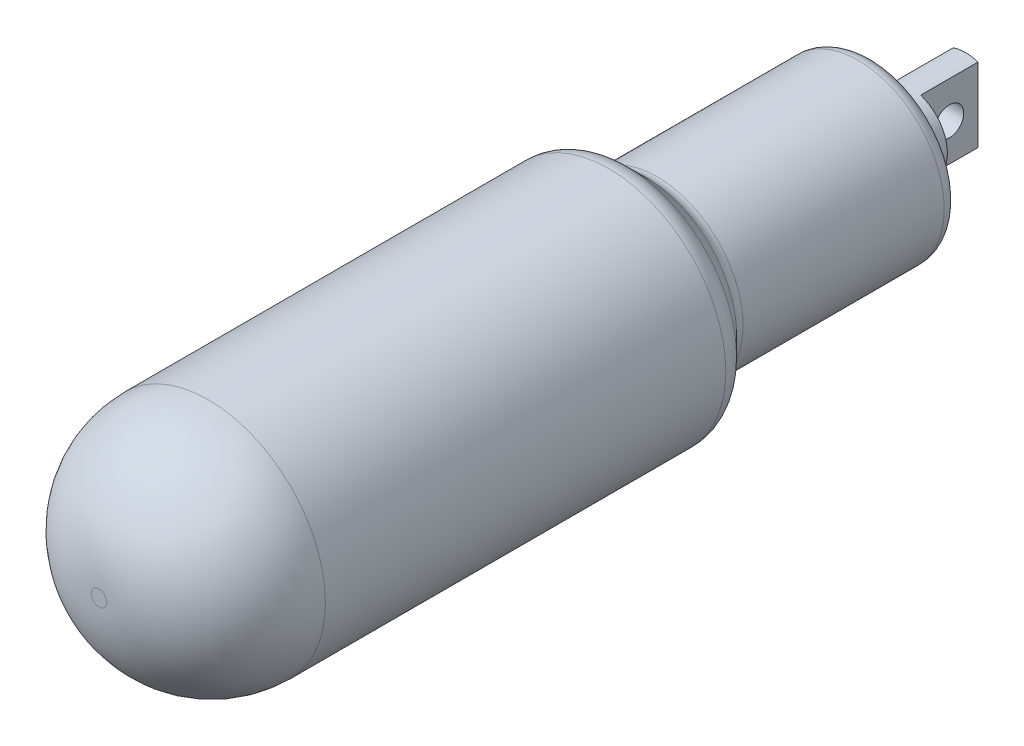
ISO-10303-21;
HEADER;
FILE_DESCRIPTION(('STEP AP214'),'2;1');
FILE_NAME('part.step','',(''),(''),'','','');
FILE_SCHEMA(('AUTOMOTIVE_DESIGN { 1 0 10303 214 1 1 1 1 }'));
ENDSEC;
DATA;
#1=APPLICATION_CONTEXT('core data for automotive mechanical design processes');
#2=APPLICATION_PROTOCOL_DEFINITION('international standard','automotive_design',2000,#1);
#3=PRODUCT_CONTEXT('',#1,'mechanical');
#4=PRODUCT('Part','Part','',(#3));
#5=PRODUCT_RELATED_PRODUCT_CATEGORY('part','',(#4));
#6=PRODUCT_DEFINITION_FORMATION('','',#4);
#7=PRODUCT_DEFINITION_CONTEXT('part definition',#1,'design');
#8=PRODUCT_DEFINITION('design','',#6,#7);
#9=PRODUCT_DEFINITION_SHAPE('','',#8);
#10=(LENGTH_UNIT() NAMED_UNIT(*) SI_UNIT(.MILLI.,.METRE.));
#11=(NAMED_UNIT(*) PLANE_ANGLE_UNIT() SI_UNIT($,.RADIAN.));
#12=(NAMED_UNIT(*) SI_UNIT($,.STERADIAN.) SOLID_ANGLE_UNIT());
#13=UNCERTAINTY_MEASURE_WITH_UNIT(LENGTH_MEASURE(1.E-05),#10,'distance_accuracy_value','');
#14=(GEOMETRIC_REPRESENTATION_CONTEXT(3) GLOBAL_UNCERTAINTY_ASSIGNED_CONTEXT((#13)) GLOBAL_UNIT_ASSIGNED_CONTEXT((#10,
#11,#12)) REPRESENTATION_CONTEXT('',''));
#15=CARTESIAN_POINT('',(0.,0.,0.));
#16=DIRECTION('',(0.,0.,1.));
#17=DIRECTION('',(1.,0.,0.));
#18=AXIS2_PLACEMENT_3D('',#15,#16,#17);
#19=CARTESIAN_POINT('',(0.,0.,-2.19999560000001));
#20=DIRECTION('',(0.,0.,1.));
#21=DIRECTION('',(-1.,0.,0.));
#22=AXIS2_PLACEMENT_3D('',#19,#20,#21);
#23=CYLINDRICAL_SURFACE('',#22,2.99999997);
#24=CARTESIAN_POINT('',(0.,0.,4.84000439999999));
#25=DIRECTION('',(0.,0.,1.));
#26=DIRECTION('',(-1.,0.,0.));
#27=AXIS2_PLACEMENT_3D('',#24,#25,#26);
#28=CIRCLE('',#27,2.99999997);
#29=CARTESIAN_POINT('',(-2.99999997,0.,4.84000439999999));
#30=VERTEX_POINT('',#29);
#31=EDGE_CURVE('E99',#30,#30,#28,.T.);
#32=ORIENTED_EDGE('',*,*,#31,.F.);
#33=EDGE_LOOP('',(#32));
#34=FACE_BOUND('',#33,.T.);
#35=DIRECTION('',(0.,0.,1.));
#36=VECTOR('',#35,1.);
#37=CARTESIAN_POINT('',(0.95275598,2.84468906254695,-2.19999560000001));
#38=LINE('',#37,#36);
#39=CARTESIAN_POINT('',(0.95275598,2.84468906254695,-2.19999560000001));
#40=VERTEX_POINT('',#39);
#41=CARTESIAN_POINT('',(0.95275598,2.84468906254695,2.20000321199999));
#42=VERTEX_POINT('',#41);
#43=EDGE_CURVE('E105',#40,#42,#38,.T.);
#44=ORIENTED_EDGE('',*,*,#43,.F.);
#45=CARTESIAN_POINT('',(0.,0.,-2.19999560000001));
#46=DIRECTION('',(0.,0.,1.));
#47=DIRECTION('',(-1.,0.,0.));
#48=AXIS2_PLACEMENT_3D('',#45,#46,#47);
#49=CIRCLE('',#48,2.99999997);
#50=CARTESIAN_POINT('',(-0.95275598,2.84468906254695,-2.19999560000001));
#51=VERTEX_POINT('',#50);
#52=EDGE_CURVE('E104',#40,#51,#49,.T.);
#53=ORIENTED_EDGE('',*,*,#52,.T.);
#54=DIRECTION('',(0.,0.,1.));
#55=VECTOR('',#54,1.);
#56=CARTESIAN_POINT('',(-0.95275598,2.84468906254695,-2.19999560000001));
#57=LINE('',#56,#55);
#58=CARTESIAN_POINT('',(-0.95275598,2.84468906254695,2.20000321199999));
#59=VERTEX_POINT('',#58);
#60=EDGE_CURVE('E29',#59,#51,#57,.F.);
#61=ORIENTED_EDGE('',*,*,#60,.F.);
#62=CARTESIAN_POINT('',(0.,0.,2.20000321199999));
#63=DIRECTION('',(0.,0.,-1.));
#64=DIRECTION('',(1.,0.,0.));
#65=AXIS2_PLACEMENT_3D('',#62,#63,#64);
#66=CIRCLE('',#65,2.99999997);
#67=CARTESIAN_POINT('',(-0.95275598,-2.84468906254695,2.20000321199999));
#68=VERTEX_POINT('',#67);
#69=EDGE_CURVE('E22',#68,#59,#66,.T.);
#70=ORIENTED_EDGE('',*,*,#69,.F.);
#71=DIRECTION('',(0.,0.,1.));
#72=VECTOR('',#71,1.);
#73=CARTESIAN_POINT('',(-0.95275598,-2.84468906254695,-2.19999560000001));
#74=LINE('',#73,#72);
#75=CARTESIAN_POINT('',(-0.95275598,-2.84468906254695,-2.19999560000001));
#76=VERTEX_POINT('',#75);
#77=EDGE_CURVE('E54',#76,#68,#74,.T.);
#78=ORIENTED_EDGE('',*,*,#77,.F.);
#79=CARTESIAN_POINT('',(0.95275598,-2.84468906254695,-2.19999560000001));
#80=VERTEX_POINT('',#79);
#81=EDGE_CURVE('E102',#76,#80,#49,.T.);
#82=ORIENTED_EDGE('',*,*,#81,.T.);
#83=DIRECTION('',(0.,0.,1.));
#84=VECTOR('',#83,1.);
#85=CARTESIAN_POINT('',(0.95275598,-2.84468906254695,-2.19999560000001));
#86=LINE('',#85,#84);
#87=CARTESIAN_POINT('',(0.95275598,-2.84468906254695,2.20000321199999));
#88=VERTEX_POINT('',#87);
#89=EDGE_CURVE('E37',#88,#80,#86,.F.);
#90=ORIENTED_EDGE('',*,*,#89,.F.);
#91=CARTESIAN_POINT('',(0.,0.,2.20000321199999));
#92=DIRECTION('',(0.,0.,-1.));
#93=DIRECTION('',(1.,0.,0.));
#94=AXIS2_PLACEMENT_3D('',#91,#92,#93);
#95=CIRCLE('',#94,2.99999997);
#96=EDGE_CURVE('E9',#42,#88,#95,.T.);
#97=ORIENTED_EDGE('',*,*,#96,.F.);
#98=EDGE_LOOP('',(#44,#53,#61,#70,#78,#82,#90,#97));
#99=FACE_BOUND('',#98,.T.);
#100=ADVANCED_FACE('F14',(#34,#99),#23,.T.);
#101=CARTESIAN_POINT('',(0.,-2.99999997,-2.19999560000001));
#102=DIRECTION('',(0.,0.,1.));
#103=DIRECTION('',(-1.,0.,0.));
#104=AXIS2_PLACEMENT_3D('',#101,#102,#103);
#105=PLANE('',#104);
#106=DIRECTION('',(0.,1.,0.));
#107=VECTOR('',#106,1.);
#108=CARTESIAN_POINT('',(0.95275598,-2.99999997,-2.19999560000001));
#109=LINE('',#108,#107);
#110=EDGE_CURVE('E71',#80,#40,#109,.T.);
#111=ORIENTED_EDGE('',*,*,#110,.F.);
#112=ORIENTED_EDGE('',*,*,#81,.F.);
#113=DIRECTION('',(0.,-1.,0.));
#114=VECTOR('',#113,1.);
#115=CARTESIAN_POINT('',(-0.95275598,-2.99999997,-2.19999560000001));
#116=LINE('',#115,#114);
#117=EDGE_CURVE('E58',#51,#76,#116,.T.);
#118=ORIENTED_EDGE('',*,*,#117,.F.);
#119=ORIENTED_EDGE('',*,*,#52,.F.);
#120=EDGE_LOOP('',(#111,#112,#118,#119));
#121=FACE_BOUND('',#120,.T.);
#122=ADVANCED_FACE('F127',(#121),#105,.F.);
#123=CARTESIAN_POINT('',(0.,0.,64.400002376));
#124=DIRECTION('',(0.,0.,-1.));
#125=DIRECTION('',(1.,0.,0.));
#126=AXIS2_PLACEMENT_3D('',#123,#124,#125);
#127=PLANE('',#126);
#128=CARTESIAN_POINT('',(0.,0.,64.400002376));
#129=DIRECTION('',(0.,0.,1.));
#130=DIRECTION('',(-1.,0.,0.));
#131=AXIS2_PLACEMENT_3D('',#128,#129,#130);
#132=CIRCLE('',#131,0.600000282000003);
#133=CARTESIAN_POINT('',(-0.600000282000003,0.,64.400002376));
#134=VERTEX_POINT('',#133);
#135=EDGE_CURVE('E75',#134,#134,#132,.T.);
#136=ORIENTED_EDGE('',*,*,#135,.T.);
#137=EDGE_LOOP('',(#136));
#138=FACE_BOUND('',#137,.T.);
#139=ADVANCED_FACE('F16',(#138),#127,.F.);
#140=CARTESIAN_POINT('',(0.,0.,56.00000246));
#141=DIRECTION('',(0.,0.,1.));
#142=DIRECTION('',(-1.,0.,0.));
#143=AXIS2_PLACEMENT_3D('',#140,#141,#142);
#144=DEGENERATE_TOROIDAL_SURFACE('',#143,0.600000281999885,8.39999991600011,.T.);
#145=ORIENTED_EDGE('',*,*,#135,.F.);
#146=EDGE_LOOP('',(#145));
#147=FACE_BOUND('',#146,.T.);
#148=CARTESIAN_POINT('',(0.,0.,56.00000246));
#149=DIRECTION('',(0.,0.,1.));
#150=DIRECTION('',(-1.,0.,0.));
#151=AXIS2_PLACEMENT_3D('',#148,#149,#150);
#152=CIRCLE('',#151,9.000000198);
#153=CARTESIAN_POINT('',(-9.000000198,0.,56.00000246));
#154=VERTEX_POINT('',#153);
#155=EDGE_CURVE('E78',#154,#154,#152,.T.);
#156=ORIENTED_EDGE('',*,*,#155,.T.);
#157=EDGE_LOOP('',(#156));
#158=FACE_BOUND('',#157,.T.);
#159=ADVANCED_FACE('F136',(#147,#158),#144,.T.);
#160=CARTESIAN_POINT('',(0.,0.,-2.19999560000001));
#161=DIRECTION('',(0.,0.,1.));
#162=DIRECTION('',(-1.,0.,0.));
#163=AXIS2_PLACEMENT_3D('',#160,#161,#162);
#164=CYLINDRICAL_SURFACE('',#163,9.000000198);
#165=ORIENTED_EDGE('',*,*,#155,.F.);
#166=EDGE_LOOP('',(#165));
#167=FACE_BOUND('',#166,.T.);
#168=CARTESIAN_POINT('',(0.,0.,25.228429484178));
#169=DIRECTION('',(0.,0.,1.));
#170=DIRECTION('',(-1.,0.,0.));
#171=AXIS2_PLACEMENT_3D('',#168,#169,#170);
#172=CIRCLE('',#171,9.000000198);
#173=CARTESIAN_POINT('',(-9.000000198,0.,25.228429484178));
#174=VERTEX_POINT('',#173);
#175=EDGE_CURVE('E81',#174,#174,#172,.T.);
#176=ORIENTED_EDGE('',*,*,#175,.T.);
#177=EDGE_LOOP('',(#176));
#178=FACE_BOUND('',#177,.T.);
#179=ADVANCED_FACE('F165',(#167,#178),#164,.T.);
#180=CARTESIAN_POINT('',(0.,0.,25.2284294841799));
#181=DIRECTION('',(0.,0.,1.));
#182=DIRECTION('',(-1.,0.,0.));
#183=AXIS2_PLACEMENT_3D('',#180,#181,#182);
#184=TOROIDAL_SURFACE('',#183,7.00000023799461,1.99999996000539);
#185=ORIENTED_EDGE('',*,*,#175,.F.);
#186=EDGE_LOOP('',(#185));
#187=FACE_BOUND('',#186,.T.);
#188=CARTESIAN_POINT('',(0.,0.,23.814215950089));
#189=DIRECTION('',(0.,0.,1.));
#190=DIRECTION('',(-1.,0.,0.));
#191=AXIS2_PLACEMENT_3D('',#188,#189,#190);
#192=CIRCLE('',#191,8.414213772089);
#193=CARTESIAN_POINT('',(-8.414213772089,0.,23.814215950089));
#194=VERTEX_POINT('',#193);
#195=EDGE_CURVE('E84',#194,#194,#192,.T.);
#196=ORIENTED_EDGE('',*,*,#195,.T.);
#197=EDGE_LOOP('',(#196));
#198=FACE_BOUND('',#197,.T.);
#199=ADVANCED_FACE('F161',(#187,#198),#184,.T.);
#200=CARTESIAN_POINT('',(0.,0.,22.351474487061));
#201=DIRECTION('',(0.,0.,1.));
#202=DIRECTION('',(-1.,0.,0.));
#203=AXIS2_PLACEMENT_3D('',#200,#201,#202);
#204=CONICAL_SURFACE('',#203,6.951472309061,0.78539816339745);
#205=ORIENTED_EDGE('',*,*,#195,.F.);
#206=EDGE_LOOP('',(#205));
#207=FACE_BOUND('',#206,.T.);
#208=CARTESIAN_POINT('',(0.,0.,22.351474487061));
#209=DIRECTION('',(0.,0.,1.));
#210=DIRECTION('',(-1.,0.,0.));
#211=AXIS2_PLACEMENT_3D('',#208,#209,#210);
#212=CIRCLE('',#211,6.951472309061);
#213=CARTESIAN_POINT('',(-6.951472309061,0.,22.351474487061));
#214=VERTEX_POINT('',#213);
#215=EDGE_CURVE('E87',#214,#214,#212,.T.);
#216=ORIENTED_EDGE('',*,*,#215,.T.);
#217=EDGE_LOOP('',(#216));
#218=FACE_BOUND('',#217,.T.);
#219=ADVANCED_FACE('F157',(#207,#218),#204,.T.);
#220=CARTESIAN_POINT('',(0.,0.,21.5029463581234));
#221=DIRECTION('',(0.,0.,1.));
#222=DIRECTION('',(-1.,0.,0.));
#223=AXIS2_PLACEMENT_3D('',#220,#221,#222);
#224=TOROIDAL_SURFACE('',#223,7.80000043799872,1.19999998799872);
#225=ORIENTED_EDGE('',*,*,#215,.F.);
#226=EDGE_LOOP('',(#225));
#227=FACE_BOUND('',#226,.T.);
#228=CARTESIAN_POINT('',(0.,0.,21.502946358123));
#229=DIRECTION('',(0.,0.,1.));
#230=DIRECTION('',(-1.,0.,0.));
#231=AXIS2_PLACEMENT_3D('',#228,#229,#230);
#232=CIRCLE('',#231,6.60000045);
#233=CARTESIAN_POINT('',(-6.60000045,0.,21.502946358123));
#234=VERTEX_POINT('',#233);
#235=EDGE_CURVE('E90',#234,#234,#232,.T.);
#236=ORIENTED_EDGE('',*,*,#235,.T.);
#237=EDGE_LOOP('',(#236));
#238=FACE_BOUND('',#237,.T.);
#239=ADVANCED_FACE('F153',(#227,#238),#224,.F.);
#240=CARTESIAN_POINT('',(0.,0.,-2.19999560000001));
#241=DIRECTION('',(0.,0.,1.));
#242=DIRECTION('',(-1.,0.,0.));
#243=AXIS2_PLACEMENT_3D('',#240,#241,#242);
#244=CYLINDRICAL_SURFACE('',#243,6.60000045);
#245=ORIENTED_EDGE('',*,*,#235,.F.);
#246=EDGE_LOOP('',(#245));
#247=FACE_BOUND('',#246,.T.);
#248=CARTESIAN_POINT('',(0.,0.,6.040004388));
#249=DIRECTION('',(0.,0.,1.));
#250=DIRECTION('',(-1.,0.,0.));
#251=AXIS2_PLACEMENT_3D('',#248,#249,#250);
#252=CIRCLE('',#251,6.60000045);
#253=CARTESIAN_POINT('',(-6.60000045,0.,6.040004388));
#254=VERTEX_POINT('',#253);
#255=EDGE_CURVE('E93',#254,#254,#252,.T.);
#256=ORIENTED_EDGE('',*,*,#255,.T.);
#257=EDGE_LOOP('',(#256));
#258=FACE_BOUND('',#257,.T.);
#259=ADVANCED_FACE('F149',(#247,#258),#244,.T.);
#260=CARTESIAN_POINT('',(0.,0.,6.04000438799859));
#261=DIRECTION('',(0.,0.,1.));
#262=DIRECTION('',(-1.,0.,0.));
#263=AXIS2_PLACEMENT_3D('',#260,#261,#262);
#264=TOROIDAL_SURFACE('',#263,5.40000046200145,1.19999998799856);
#265=ORIENTED_EDGE('',*,*,#255,.F.);
#266=EDGE_LOOP('',(#265));
#267=FACE_BOUND('',#266,.T.);
#268=CARTESIAN_POINT('',(0.,0.,4.84000439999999));
#269=DIRECTION('',(0.,0.,1.));
#270=DIRECTION('',(-1.,0.,0.));
#271=AXIS2_PLACEMENT_3D('',#268,#269,#270);
#272=CIRCLE('',#271,5.400000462);
#273=CARTESIAN_POINT('',(-5.400000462,0.,4.84000439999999));
#274=VERTEX_POINT('',#273);
#275=EDGE_CURVE('E96',#274,#274,#272,.T.);
#276=ORIENTED_EDGE('',*,*,#275,.T.);
#277=EDGE_LOOP('',(#276));
#278=FACE_BOUND('',#277,.T.);
#279=ADVANCED_FACE('F145',(#267,#278),#264,.T.);
#280=CARTESIAN_POINT('',(0.,-5.400000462,4.84000439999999));
#281=DIRECTION('',(0.,0.,1.));
#282=DIRECTION('',(-1.,0.,0.));
#283=AXIS2_PLACEMENT_3D('',#280,#281,#282);
#284=PLANE('',#283);
#285=ORIENTED_EDGE('',*,*,#275,.F.);
#286=EDGE_LOOP('',(#285));
#287=FACE_BOUND('',#286,.T.);
#288=ORIENTED_EDGE('',*,*,#31,.T.);
#289=EDGE_LOOP('',(#288));
#290=FACE_BOUND('',#289,.T.);
#291=ADVANCED_FACE('F142',(#287,#290),#284,.F.);
#292=CARTESIAN_POINT('',(-0.95275598,-22.,-3.89199678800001));
#293=DIRECTION('',(-1.,0.,0.));
#294=DIRECTION('',(0.,-1.,0.));
#295=AXIS2_PLACEMENT_3D('',#292,#293,#294);
#296=PLANE('',#295);
#297=CARTESIAN_POINT('',(-0.952755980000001,0.,0.));
#298=DIRECTION('',(-1.,0.,0.));
#299=DIRECTION('',(0.,-1.,0.));
#300=AXIS2_PLACEMENT_3D('',#297,#298,#299);
#301=CIRCLE('',#300,1.1);
#302=CARTESIAN_POINT('',(-0.952755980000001,-1.1,0.));
#303=VERTEX_POINT('',#302);
#304=EDGE_CURVE('E67',#303,#303,#301,.T.);
#305=ORIENTED_EDGE('',*,*,#304,.F.);
#306=EDGE_LOOP('',(#305));
#307=FACE_BOUND('',#306,.T.);
#308=ORIENTED_EDGE('',*,*,#77,.T.);
#309=DIRECTION('',(0.,1.,0.));
#310=VECTOR('',#309,1.);
#311=CARTESIAN_POINT('',(-0.95275598,-22.,2.20000321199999));
#312=LINE('',#311,#310);
#313=EDGE_CURVE('E57',#68,#59,#312,.T.);
#314=ORIENTED_EDGE('',*,*,#313,.T.);
#315=ORIENTED_EDGE('',*,*,#60,.T.);
#316=ORIENTED_EDGE('',*,*,#117,.T.);
#317=EDGE_LOOP('',(#308,#314,#315,#316));
#318=FACE_BOUND('',#317,.T.);
#319=ADVANCED_FACE('F56',(#307,#318),#296,.T.);
#320=CARTESIAN_POINT('',(-0.95275598,-22.,2.20000321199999));
#321=DIRECTION('',(0.,0.,-1.));
#322=DIRECTION('',(1.,0.,0.));
#323=AXIS2_PLACEMENT_3D('',#320,#321,#322);
#324=PLANE('',#323);
#325=ORIENTED_EDGE('',*,*,#69,.T.);
#326=ORIENTED_EDGE('',*,*,#313,.F.);
#327=EDGE_LOOP('',(#325,#326));
#328=FACE_BOUND('',#327,.T.);
#329=ADVANCED_FACE('F65',(#328),#324,.T.);
#330=CARTESIAN_POINT('',(3.4927559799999,-22.,2.20000321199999));
#331=DIRECTION('',(0.,0.,-1.));
#332=DIRECTION('',(1.,0.,0.));
#333=AXIS2_PLACEMENT_3D('',#330,#331,#332);
#334=PLANE('',#333);
#335=ORIENTED_EDGE('',*,*,#96,.T.);
#336=DIRECTION('',(0.,1.,0.));
#337=VECTOR('',#336,1.);
#338=CARTESIAN_POINT('',(0.95275598,-22.,2.20000321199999));
#339=LINE('',#338,#337);
#340=EDGE_CURVE('E66',#88,#42,#339,.T.);
#341=ORIENTED_EDGE('',*,*,#340,.T.);
#342=EDGE_LOOP('',(#335,#341));
#343=FACE_BOUND('',#342,.T.);
#344=ADVANCED_FACE('F121',(#343),#334,.T.);
#345=CARTESIAN_POINT('',(0.95275598,-22.,2.20000321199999));
#346=DIRECTION('',(1.,0.,0.));
#347=DIRECTION('',(0.,1.,0.));
#348=AXIS2_PLACEMENT_3D('',#345,#346,#347);
#349=PLANE('',#348);
#350=CARTESIAN_POINT('',(0.95275598,0.,0.));
#351=DIRECTION('',(1.,0.,0.));
#352=DIRECTION('',(0.,1.,0.));
#353=AXIS2_PLACEMENT_3D('',#350,#351,#352);
#354=CIRCLE('',#353,1.1);
#355=CARTESIAN_POINT('',(0.95275598,1.1,0.));
#356=VERTEX_POINT('',#355);
#357=EDGE_CURVE('E113',#356,#356,#354,.T.);
#358=ORIENTED_EDGE('',*,*,#357,.F.);
#359=EDGE_LOOP('',(#358));
#360=FACE_BOUND('',#359,.T.);
#361=ORIENTED_EDGE('',*,*,#43,.T.);
#362=ORIENTED_EDGE('',*,*,#340,.F.);
#363=ORIENTED_EDGE('',*,*,#89,.T.);
#364=ORIENTED_EDGE('',*,*,#110,.T.);
#365=EDGE_LOOP('',(#361,#362,#363,#364));
#366=FACE_BOUND('',#365,.T.);
#367=ADVANCED_FACE('F119',(#360,#366),#349,.T.);
#368=CARTESIAN_POINT('',(-9.000000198,0.,0.));
#369=DIRECTION('',(1.,0.,0.));
#370=DIRECTION('',(0.,1.,0.));
#371=AXIS2_PLACEMENT_3D('',#368,#369,#370);
#372=CYLINDRICAL_SURFACE('',#371,1.1);
#373=ORIENTED_EDGE('',*,*,#304,.T.);
#374=EDGE_LOOP('',(#373));
#375=FACE_BOUND('',#374,.T.);
#376=ORIENTED_EDGE('',*,*,#357,.T.);
#377=EDGE_LOOP('',(#376));
#378=FACE_BOUND('',#377,.T.);
#379=ADVANCED_FACE('F117',(#375,#378),#372,.F.);
#380=CLOSED_SHELL('',(#100,#122,#139,#159,#179,#199,#219,#239,#259,#279,#291,#319,#329,#344,
#367,#379));
#381=MANIFOLD_SOLID_BREP('B1',#380);
#382=ADVANCED_BREP_SHAPE_REPRESENTATION('',(#18,#381),#14);
#383=SHAPE_DEFINITION_REPRESENTATION(#9,#382);
ENDSEC;
END-ISO-10303-21;
